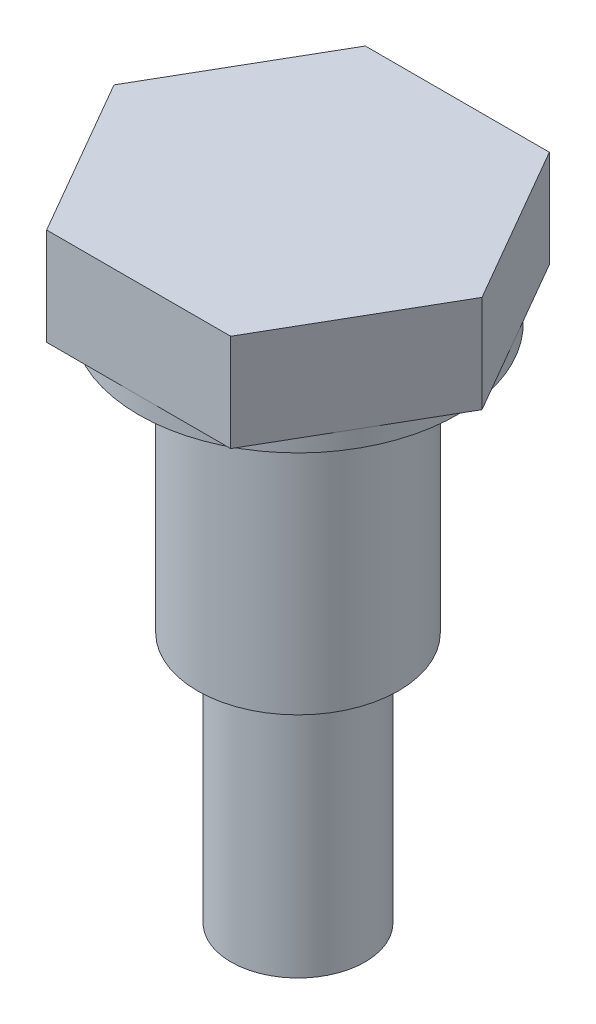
ISO-10303-21;
HEADER;
FILE_DESCRIPTION(('STEP AP214'),'2;1');
FILE_NAME('part.step','',(''),(''),'','','');
FILE_SCHEMA(('AUTOMOTIVE_DESIGN { 1 0 10303 214 1 1 1 1 }'));
ENDSEC;
DATA;
#1=APPLICATION_CONTEXT('core data for automotive mechanical design processes');
#2=APPLICATION_PROTOCOL_DEFINITION('international standard','automotive_design',2000,#1);
#3=PRODUCT_CONTEXT('',#1,'mechanical');
#4=PRODUCT('Part','Part','',(#3));
#5=PRODUCT_RELATED_PRODUCT_CATEGORY('part','',(#4));
#6=PRODUCT_DEFINITION_FORMATION('','',#4);
#7=PRODUCT_DEFINITION_CONTEXT('part definition',#1,'design');
#8=PRODUCT_DEFINITION('design','',#6,#7);
#9=PRODUCT_DEFINITION_SHAPE('','',#8);
#10=(LENGTH_UNIT() NAMED_UNIT(*) SI_UNIT(.MILLI.,.METRE.));
#11=(NAMED_UNIT(*) PLANE_ANGLE_UNIT() SI_UNIT($,.RADIAN.));
#12=(NAMED_UNIT(*) SI_UNIT($,.STERADIAN.) SOLID_ANGLE_UNIT());
#13=UNCERTAINTY_MEASURE_WITH_UNIT(LENGTH_MEASURE(1.E-05),#10,'distance_accuracy_value','');
#14=(GEOMETRIC_REPRESENTATION_CONTEXT(3) GLOBAL_UNCERTAINTY_ASSIGNED_CONTEXT((#13)) GLOBAL_UNIT_ASSIGNED_CONTEXT((#10,
#11,#12)) REPRESENTATION_CONTEXT('',''));
#15=CARTESIAN_POINT('',(0.,0.,0.));
#16=DIRECTION('',(0.,0.,1.));
#17=DIRECTION('',(1.,0.,0.));
#18=AXIS2_PLACEMENT_3D('',#15,#16,#17);
#19=CARTESIAN_POINT('',(0.,15.,0.));
#20=DIRECTION('',(0.,-1.,0.));
#21=DIRECTION('',(0.,0.,-1.));
#22=AXIS2_PLACEMENT_3D('',#19,#20,#21);
#23=CYLINDRICAL_SURFACE('',#22,4.);
#24=CARTESIAN_POINT('',(0.,15.,0.));
#25=DIRECTION('',(0.,1.,0.));
#26=DIRECTION('',(0.,0.,1.));
#27=AXIS2_PLACEMENT_3D('',#24,#25,#26);
#28=CIRCLE('',#27,4.);
#29=CARTESIAN_POINT('',(0.,15.,4.));
#30=VERTEX_POINT('',#29);
#31=EDGE_CURVE('E11',#30,#30,#28,.T.);
#32=ORIENTED_EDGE('',*,*,#31,.F.);
#33=EDGE_LOOP('',(#32));
#34=FACE_BOUND('',#33,.T.);
#35=CARTESIAN_POINT('',(0.,0.,0.));
#36=DIRECTION('',(0.,1.,0.));
#37=DIRECTION('',(0.,0.,1.));
#38=AXIS2_PLACEMENT_3D('',#35,#36,#37);
#39=CIRCLE('',#38,4.);
#40=CARTESIAN_POINT('',(0.,0.,4.));
#41=VERTEX_POINT('',#40);
#42=EDGE_CURVE('E35',#41,#41,#39,.T.);
#43=ORIENTED_EDGE('',*,*,#42,.T.);
#44=EDGE_LOOP('',(#43));
#45=FACE_BOUND('',#44,.T.);
#46=ADVANCED_FACE('F32',(#34,#45),#23,.T.);
#47=CARTESIAN_POINT('',(0.,0.,0.));
#48=DIRECTION('',(0.,1.,0.));
#49=DIRECTION('',(0.,0.,1.));
#50=AXIS2_PLACEMENT_3D('',#47,#48,#49);
#51=PLANE('',#50);
#52=ORIENTED_EDGE('',*,*,#42,.F.);
#53=EDGE_LOOP('',(#52));
#54=FACE_BOUND('',#53,.T.);
#55=ADVANCED_FACE('F151',(#54),#51,.F.);
#56=CARTESIAN_POINT('',(0.,15.,0.));
#57=DIRECTION('',(0.,1.,0.));
#58=DIRECTION('',(0.,0.,1.));
#59=AXIS2_PLACEMENT_3D('',#56,#57,#58);
#60=PLANE('',#59);
#61=CARTESIAN_POINT('',(0.,15.,0.));
#62=DIRECTION('',(0.,1.,0.));
#63=DIRECTION('',(0.,0.,1.));
#64=AXIS2_PLACEMENT_3D('',#61,#62,#63);
#65=CIRCLE('',#64,6.);
#66=CARTESIAN_POINT('',(0.,15.,6.));
#67=VERTEX_POINT('',#66);
#68=EDGE_CURVE('E137',#67,#67,#65,.T.);
#69=ORIENTED_EDGE('',*,*,#68,.F.);
#70=EDGE_LOOP('',(#69));
#71=FACE_BOUND('',#70,.T.);
#72=ORIENTED_EDGE('',*,*,#31,.T.);
#73=EDGE_LOOP('',(#72));
#74=FACE_BOUND('',#73,.T.);
#75=ADVANCED_FACE('F148',(#71,#74),#60,.F.);
#76=CARTESIAN_POINT('',(0.,31.,0.));
#77=DIRECTION('',(0.,-1.,0.));
#78=DIRECTION('',(0.,0.,-1.));
#79=AXIS2_PLACEMENT_3D('',#76,#77,#78);
#80=CYLINDRICAL_SURFACE('',#79,6.);
#81=CARTESIAN_POINT('',(0.,31.,0.));
#82=DIRECTION('',(0.,1.,0.));
#83=DIRECTION('',(0.,0.,1.));
#84=AXIS2_PLACEMENT_3D('',#81,#82,#83);
#85=CIRCLE('',#84,6.);
#86=CARTESIAN_POINT('',(0.,31.,6.));
#87=VERTEX_POINT('',#86);
#88=EDGE_CURVE('E140',#87,#87,#85,.T.);
#89=ORIENTED_EDGE('',*,*,#88,.F.);
#90=EDGE_LOOP('',(#89));
#91=FACE_BOUND('',#90,.T.);
#92=ORIENTED_EDGE('',*,*,#68,.T.);
#93=EDGE_LOOP('',(#92));
#94=FACE_BOUND('',#93,.T.);
#95=ADVANCED_FACE('F146',(#91,#94),#80,.T.);
#96=CARTESIAN_POINT('',(0.,31.,0.));
#97=DIRECTION('',(0.,1.,0.));
#98=DIRECTION('',(0.,0.,1.));
#99=AXIS2_PLACEMENT_3D('',#96,#97,#98);
#100=PLANE('',#99);
#101=CARTESIAN_POINT('',(0.,31.,0.));
#102=DIRECTION('',(0.,1.,0.));
#103=DIRECTION('',(0.,0.,1.));
#104=AXIS2_PLACEMENT_3D('',#101,#102,#103);
#105=CIRCLE('',#104,9.5);
#106=CARTESIAN_POINT('',(0.,31.,9.5));
#107=VERTEX_POINT('',#106);
#108=EDGE_CURVE('E127',#107,#107,#105,.T.);
#109=ORIENTED_EDGE('',*,*,#108,.F.);
#110=EDGE_LOOP('',(#109));
#111=FACE_BOUND('',#110,.T.);
#112=ORIENTED_EDGE('',*,*,#88,.T.);
#113=EDGE_LOOP('',(#112));
#114=FACE_BOUND('',#113,.T.);
#115=ADVANCED_FACE('F165',(#111,#114),#100,.F.);
#116=CARTESIAN_POINT('',(0.,32.,0.));
#117=DIRECTION('',(0.,-1.,0.));
#118=DIRECTION('',(0.,0.,-1.));
#119=AXIS2_PLACEMENT_3D('',#116,#117,#118);
#120=CYLINDRICAL_SURFACE('',#119,9.5);
#121=CARTESIAN_POINT('',(0.,32.,0.));
#122=DIRECTION('',(0.,1.,0.));
#123=DIRECTION('',(0.,0.,1.));
#124=AXIS2_PLACEMENT_3D('',#121,#122,#123);
#125=CIRCLE('',#124,9.5);
#126=CARTESIAN_POINT('',(0.,32.,9.5));
#127=VERTEX_POINT('',#126);
#128=CARTESIAN_POINT('',(8.22724133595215,32.,4.75000000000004));
#129=VERTEX_POINT('',#128);
#130=EDGE_CURVE('E135',#127,#129,#125,.T.);
#131=ORIENTED_EDGE('',*,*,#130,.F.);
#132=CARTESIAN_POINT('',(-8.22724133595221,32.,4.74999999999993));
#133=VERTEX_POINT('',#132);
#134=EDGE_CURVE('E46',#133,#127,#125,.T.);
#135=ORIENTED_EDGE('',*,*,#134,.F.);
#136=CARTESIAN_POINT('',(-8.22724133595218,32.,-4.74999999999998));
#137=VERTEX_POINT('',#136);
#138=EDGE_CURVE('E50',#137,#133,#125,.T.);
#139=ORIENTED_EDGE('',*,*,#138,.F.);
#140=CARTESIAN_POINT('',(0.,32.,-9.5));
#141=VERTEX_POINT('',#140);
#142=EDGE_CURVE('E372',#141,#137,#125,.T.);
#143=ORIENTED_EDGE('',*,*,#142,.F.);
#144=CARTESIAN_POINT('',(8.22724133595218,32.,-4.74999999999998));
#145=VERTEX_POINT('',#144);
#146=EDGE_CURVE('E373',#145,#141,#125,.T.);
#147=ORIENTED_EDGE('',*,*,#146,.F.);
#148=EDGE_CURVE('E138',#129,#145,#125,.T.);
#149=ORIENTED_EDGE('',*,*,#148,.F.);
#150=EDGE_LOOP('',(#131,#135,#139,#143,#147,#149));
#151=FACE_BOUND('',#150,.T.);
#152=ORIENTED_EDGE('',*,*,#108,.T.);
#153=EDGE_LOOP('',(#152));
#154=FACE_BOUND('',#153,.T.);
#155=ADVANCED_FACE('F168',(#151,#154),#120,.T.);
#156=CARTESIAN_POINT('',(-5.48482755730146,32.,-9.5));
#157=DIRECTION('',(0.,-1.,0.));
#158=DIRECTION('',(0.,0.,-1.));
#159=AXIS2_PLACEMENT_3D('',#156,#157,#158);
#160=PLANE('',#159);
#161=DIRECTION('',(1.,0.,0.));
#162=VECTOR('',#161,1.);
#163=CARTESIAN_POINT('',(5.48482755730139,32.,9.50000000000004));
#164=LINE('',#163,#162);
#165=CARTESIAN_POINT('',(5.48482755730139,32.,9.50000000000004));
#166=VERTEX_POINT('',#165);
#167=EDGE_CURVE('E330',#127,#166,#164,.T.);
#168=ORIENTED_EDGE('',*,*,#167,.F.);
#169=ORIENTED_EDGE('',*,*,#130,.T.);
#170=DIRECTION('',(0.500000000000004,0.,-0.866025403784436));
#171=VECTOR('',#170,1.);
#172=CARTESIAN_POINT('',(10.9696551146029,32.,0.));
#173=LINE('',#172,#171);
#174=EDGE_CURVE('E334',#166,#129,#173,.T.);
#175=ORIENTED_EDGE('',*,*,#174,.F.);
#176=EDGE_LOOP('',(#168,#169,#175));
#177=FACE_BOUND('',#176,.T.);
#178=ADVANCED_FACE('F171',(#177),#160,.T.);
#179=CARTESIAN_POINT('',(10.9696551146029,32.,0.));
#180=VERTEX_POINT('',#179);
#181=EDGE_CURVE('E342',#129,#180,#173,.T.);
#182=ORIENTED_EDGE('',*,*,#181,.F.);
#183=ORIENTED_EDGE('',*,*,#148,.T.);
#184=DIRECTION('',(-0.499999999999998,0.,-0.86602540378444));
#185=VECTOR('',#184,1.);
#186=CARTESIAN_POINT('',(5.48482755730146,32.,-9.5));
#187=LINE('',#186,#185);
#188=EDGE_CURVE('E348',#180,#145,#187,.T.);
#189=ORIENTED_EDGE('',*,*,#188,.F.);
#190=EDGE_LOOP('',(#182,#183,#189));
#191=FACE_BOUND('',#190,.T.);
#192=ADVANCED_FACE('F266',(#191),#160,.T.);
#193=CARTESIAN_POINT('',(5.48482755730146,32.,-9.5));
#194=VERTEX_POINT('',#193);
#195=EDGE_CURVE('E347',#145,#194,#187,.T.);
#196=ORIENTED_EDGE('',*,*,#195,.F.);
#197=ORIENTED_EDGE('',*,*,#146,.T.);
#198=DIRECTION('',(-1.,0.,0.));
#199=VECTOR('',#198,1.);
#200=CARTESIAN_POINT('',(-5.48482755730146,32.,-9.5));
#201=LINE('',#200,#199);
#202=EDGE_CURVE('E120',#194,#141,#201,.T.);
#203=ORIENTED_EDGE('',*,*,#202,.F.);
#204=EDGE_LOOP('',(#196,#197,#203));
#205=FACE_BOUND('',#204,.T.);
#206=ADVANCED_FACE('F258',(#205),#160,.T.);
#207=CARTESIAN_POINT('',(-5.48482755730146,32.,-9.5));
#208=VERTEX_POINT('',#207);
#209=EDGE_CURVE('E351',#141,#208,#201,.T.);
#210=ORIENTED_EDGE('',*,*,#209,.F.);
#211=ORIENTED_EDGE('',*,*,#142,.T.);
#212=DIRECTION('',(-0.499999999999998,0.,0.86602540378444));
#213=VECTOR('',#212,1.);
#214=CARTESIAN_POINT('',(-10.9696551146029,32.,0.));
#215=LINE('',#214,#213);
#216=EDGE_CURVE('E369',#208,#137,#215,.T.);
#217=ORIENTED_EDGE('',*,*,#216,.F.);
#218=EDGE_LOOP('',(#210,#211,#217));
#219=FACE_BOUND('',#218,.T.);
#220=ADVANCED_FACE('F250',(#219),#160,.T.);
#221=CARTESIAN_POINT('',(-10.9696551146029,32.,0.));
#222=VERTEX_POINT('',#221);
#223=EDGE_CURVE('E125',#137,#222,#215,.T.);
#224=ORIENTED_EDGE('',*,*,#223,.F.);
#225=ORIENTED_EDGE('',*,*,#138,.T.);
#226=DIRECTION('',(0.499999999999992,0.,0.866025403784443));
#227=VECTOR('',#226,1.);
#228=CARTESIAN_POINT('',(-5.48482755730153,32.,9.49999999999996));
#229=LINE('',#228,#227);
#230=EDGE_CURVE('E338',#222,#133,#229,.T.);
#231=ORIENTED_EDGE('',*,*,#230,.F.);
#232=EDGE_LOOP('',(#224,#225,#231));
#233=FACE_BOUND('',#232,.T.);
#234=ADVANCED_FACE('F177',(#233),#160,.T.);
#235=CARTESIAN_POINT('',(-10.9696551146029,37.8,0.));
#236=DIRECTION('',(0.86602540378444,0.,0.499999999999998));
#237=DIRECTION('',(0.499999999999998,0.,-0.86602540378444));
#238=AXIS2_PLACEMENT_3D('',#235,#236,#237);
#239=PLANE('',#238);
#240=ORIENTED_EDGE('',*,*,#216,.T.);
#241=ORIENTED_EDGE('',*,*,#223,.T.);
#242=DIRECTION('',(0.,-1.,0.));
#243=VECTOR('',#242,1.);
#244=CARTESIAN_POINT('',(-10.9696551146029,37.8,0.));
#245=LINE('',#244,#243);
#246=CARTESIAN_POINT('',(-10.9696551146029,37.8,0.));
#247=VERTEX_POINT('',#246);
#248=EDGE_CURVE('E105',#247,#222,#245,.T.);
#249=ORIENTED_EDGE('',*,*,#248,.F.);
#250=DIRECTION('',(-0.499999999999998,0.,0.86602540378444));
#251=VECTOR('',#250,1.);
#252=CARTESIAN_POINT('',(-10.9696551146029,37.8,0.));
#253=LINE('',#252,#251);
#254=CARTESIAN_POINT('',(-5.48482755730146,37.8,-9.5));
#255=VERTEX_POINT('',#254);
#256=EDGE_CURVE('E111',#255,#247,#253,.T.);
#257=ORIENTED_EDGE('',*,*,#256,.F.);
#258=DIRECTION('',(0.,-1.,0.));
#259=VECTOR('',#258,1.);
#260=CARTESIAN_POINT('',(-5.48482755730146,37.8,-9.5));
#261=LINE('',#260,#259);
#262=EDGE_CURVE('E354',#255,#208,#261,.T.);
#263=ORIENTED_EDGE('',*,*,#262,.T.);
#264=EDGE_LOOP('',(#240,#241,#249,#257,#263));
#265=FACE_BOUND('',#264,.T.);
#266=ADVANCED_FACE('F123',(#265),#239,.F.);
#267=CARTESIAN_POINT('',(-5.48482755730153,37.8,9.49999999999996));
#268=DIRECTION('',(0.866025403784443,0.,-0.499999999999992));
#269=DIRECTION('',(-0.499999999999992,0.,-0.866025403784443));
#270=AXIS2_PLACEMENT_3D('',#267,#268,#269);
#271=PLANE('',#270);
#272=ORIENTED_EDGE('',*,*,#230,.T.);
#273=CARTESIAN_POINT('',(-5.48482755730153,32.,9.49999999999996));
#274=VERTEX_POINT('',#273);
#275=EDGE_CURVE('E370',#133,#274,#229,.T.);
#276=ORIENTED_EDGE('',*,*,#275,.T.);
#277=DIRECTION('',(0.,-1.,0.));
#278=VECTOR('',#277,1.);
#279=CARTESIAN_POINT('',(-5.48482755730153,37.8,9.49999999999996));
#280=LINE('',#279,#278);
#281=CARTESIAN_POINT('',(-5.48482755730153,37.8,9.49999999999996));
#282=VERTEX_POINT('',#281);
#283=EDGE_CURVE('E107',#282,#274,#280,.T.);
#284=ORIENTED_EDGE('',*,*,#283,.F.);
#285=DIRECTION('',(0.499999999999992,0.,0.866025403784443));
#286=VECTOR('',#285,1.);
#287=CARTESIAN_POINT('',(-5.48482755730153,37.8,9.49999999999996));
#288=LINE('',#287,#286);
#289=EDGE_CURVE('E100',#247,#282,#288,.T.);
#290=ORIENTED_EDGE('',*,*,#289,.F.);
#291=ORIENTED_EDGE('',*,*,#248,.T.);
#292=EDGE_LOOP('',(#272,#276,#284,#290,#291));
#293=FACE_BOUND('',#292,.T.);
#294=ADVANCED_FACE('F103',(#293),#271,.F.);
#295=CARTESIAN_POINT('',(5.48482755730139,37.8,9.50000000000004));
#296=DIRECTION('',(0.,0.,-1.));
#297=DIRECTION('',(-1.,0.,0.));
#298=AXIS2_PLACEMENT_3D('',#295,#296,#297);
#299=PLANE('',#298);
#300=EDGE_CURVE('E337',#274,#127,#164,.T.);
#301=ORIENTED_EDGE('',*,*,#300,.T.);
#302=ORIENTED_EDGE('',*,*,#167,.T.);
#303=DIRECTION('',(0.,-1.,0.));
#304=VECTOR('',#303,1.);
#305=CARTESIAN_POINT('',(5.48482755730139,37.8,9.50000000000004));
#306=LINE('',#305,#304);
#307=CARTESIAN_POINT('',(5.48482755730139,37.8,9.50000000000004));
#308=VERTEX_POINT('',#307);
#309=EDGE_CURVE('E131',#308,#166,#306,.T.);
#310=ORIENTED_EDGE('',*,*,#309,.F.);
#311=DIRECTION('',(1.,0.,0.));
#312=VECTOR('',#311,1.);
#313=CARTESIAN_POINT('',(5.48482755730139,37.8,9.50000000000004));
#314=LINE('',#313,#312);
#315=EDGE_CURVE('E110',#282,#308,#314,.T.);
#316=ORIENTED_EDGE('',*,*,#315,.F.);
#317=ORIENTED_EDGE('',*,*,#283,.T.);
#318=EDGE_LOOP('',(#301,#302,#310,#316,#317));
#319=FACE_BOUND('',#318,.T.);
#320=ADVANCED_FACE('F180',(#319),#299,.F.);
#321=CARTESIAN_POINT('',(10.9696551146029,37.8,0.));
#322=DIRECTION('',(-0.866025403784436,0.,-0.500000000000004));
#323=DIRECTION('',(-0.500000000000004,0.,0.866025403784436));
#324=AXIS2_PLACEMENT_3D('',#321,#322,#323);
#325=PLANE('',#324);
#326=ORIENTED_EDGE('',*,*,#174,.T.);
#327=ORIENTED_EDGE('',*,*,#181,.T.);
#328=DIRECTION('',(0.,-1.,0.));
#329=VECTOR('',#328,1.);
#330=CARTESIAN_POINT('',(10.9696551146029,37.8,0.));
#331=LINE('',#330,#329);
#332=CARTESIAN_POINT('',(10.9696551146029,37.8,0.));
#333=VERTEX_POINT('',#332);
#334=EDGE_CURVE('E359',#333,#180,#331,.T.);
#335=ORIENTED_EDGE('',*,*,#334,.F.);
#336=DIRECTION('',(0.500000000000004,0.,-0.866025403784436));
#337=VECTOR('',#336,1.);
#338=CARTESIAN_POINT('',(10.9696551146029,37.8,0.));
#339=LINE('',#338,#337);
#340=EDGE_CURVE('E363',#308,#333,#339,.T.);
#341=ORIENTED_EDGE('',*,*,#340,.F.);
#342=ORIENTED_EDGE('',*,*,#309,.T.);
#343=EDGE_LOOP('',(#326,#327,#335,#341,#342));
#344=FACE_BOUND('',#343,.T.);
#345=ADVANCED_FACE('F183',(#344),#325,.F.);
#346=CARTESIAN_POINT('',(5.48482755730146,37.8,-9.5));
#347=DIRECTION('',(-0.86602540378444,0.,0.499999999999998));
#348=DIRECTION('',(0.499999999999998,0.,0.86602540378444));
#349=AXIS2_PLACEMENT_3D('',#346,#347,#348);
#350=PLANE('',#349);
#351=ORIENTED_EDGE('',*,*,#188,.T.);
#352=ORIENTED_EDGE('',*,*,#195,.T.);
#353=DIRECTION('',(0.,-1.,0.));
#354=VECTOR('',#353,1.);
#355=CARTESIAN_POINT('',(5.48482755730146,37.8,-9.5));
#356=LINE('',#355,#354);
#357=CARTESIAN_POINT('',(5.48482755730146,37.8,-9.5));
#358=VERTEX_POINT('',#357);
#359=EDGE_CURVE('E356',#358,#194,#356,.T.);
#360=ORIENTED_EDGE('',*,*,#359,.F.);
#361=DIRECTION('',(-0.499999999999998,0.,-0.86602540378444));
#362=VECTOR('',#361,1.);
#363=CARTESIAN_POINT('',(5.48482755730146,37.8,-9.5));
#364=LINE('',#363,#362);
#365=EDGE_CURVE('E365',#333,#358,#364,.T.);
#366=ORIENTED_EDGE('',*,*,#365,.F.);
#367=ORIENTED_EDGE('',*,*,#334,.T.);
#368=EDGE_LOOP('',(#351,#352,#360,#366,#367));
#369=FACE_BOUND('',#368,.T.);
#370=ADVANCED_FACE('F187',(#369),#350,.F.);
#371=CARTESIAN_POINT('',(-5.48482755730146,37.8,-9.5));
#372=DIRECTION('',(0.,0.,1.));
#373=DIRECTION('',(1.,0.,0.));
#374=AXIS2_PLACEMENT_3D('',#371,#372,#373);
#375=PLANE('',#374);
#376=ORIENTED_EDGE('',*,*,#202,.T.);
#377=ORIENTED_EDGE('',*,*,#209,.T.);
#378=ORIENTED_EDGE('',*,*,#262,.F.);
#379=DIRECTION('',(-1.,0.,0.));
#380=VECTOR('',#379,1.);
#381=CARTESIAN_POINT('',(-5.48482755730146,37.8,-9.5));
#382=LINE('',#381,#380);
#383=EDGE_CURVE('E116',#358,#255,#382,.T.);
#384=ORIENTED_EDGE('',*,*,#383,.F.);
#385=ORIENTED_EDGE('',*,*,#359,.T.);
#386=EDGE_LOOP('',(#376,#377,#378,#384,#385));
#387=FACE_BOUND('',#386,.T.);
#388=ADVANCED_FACE('F191',(#387),#375,.F.);
#389=CARTESIAN_POINT('',(-5.48482755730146,37.8,-9.5));
#390=DIRECTION('',(0.,-1.,0.));
#391=DIRECTION('',(0.,0.,-1.));
#392=AXIS2_PLACEMENT_3D('',#389,#390,#391);
#393=PLANE('',#392);
#394=ORIENTED_EDGE('',*,*,#256,.T.);
#395=ORIENTED_EDGE('',*,*,#289,.T.);
#396=ORIENTED_EDGE('',*,*,#315,.T.);
#397=ORIENTED_EDGE('',*,*,#340,.T.);
#398=ORIENTED_EDGE('',*,*,#365,.T.);
#399=ORIENTED_EDGE('',*,*,#383,.T.);
#400=EDGE_LOOP('',(#394,#395,#396,#397,#398,#399));
#401=FACE_BOUND('',#400,.T.);
#402=ADVANCED_FACE('F114',(#401),#393,.F.);
#403=ORIENTED_EDGE('',*,*,#275,.F.);
#404=ORIENTED_EDGE('',*,*,#134,.T.);
#405=ORIENTED_EDGE('',*,*,#300,.F.);
#406=EDGE_LOOP('',(#403,#404,#405));
#407=FACE_BOUND('',#406,.T.);
#408=ADVANCED_FACE('F196',(#407),#160,.T.);
#409=CLOSED_SHELL('',(#46,#55,#75,#95,#115,#155,#178,#192,#206,#220,#234,#266,#294,#320,#345,
#370,#388,#402,#408));
#410=MANIFOLD_SOLID_BREP('B2',#409);
#411=ADVANCED_BREP_SHAPE_REPRESENTATION('',(#18,#410),#14);
#412=SHAPE_DEFINITION_REPRESENTATION(#9,#411);
ENDSEC;
END-ISO-10303-21;
